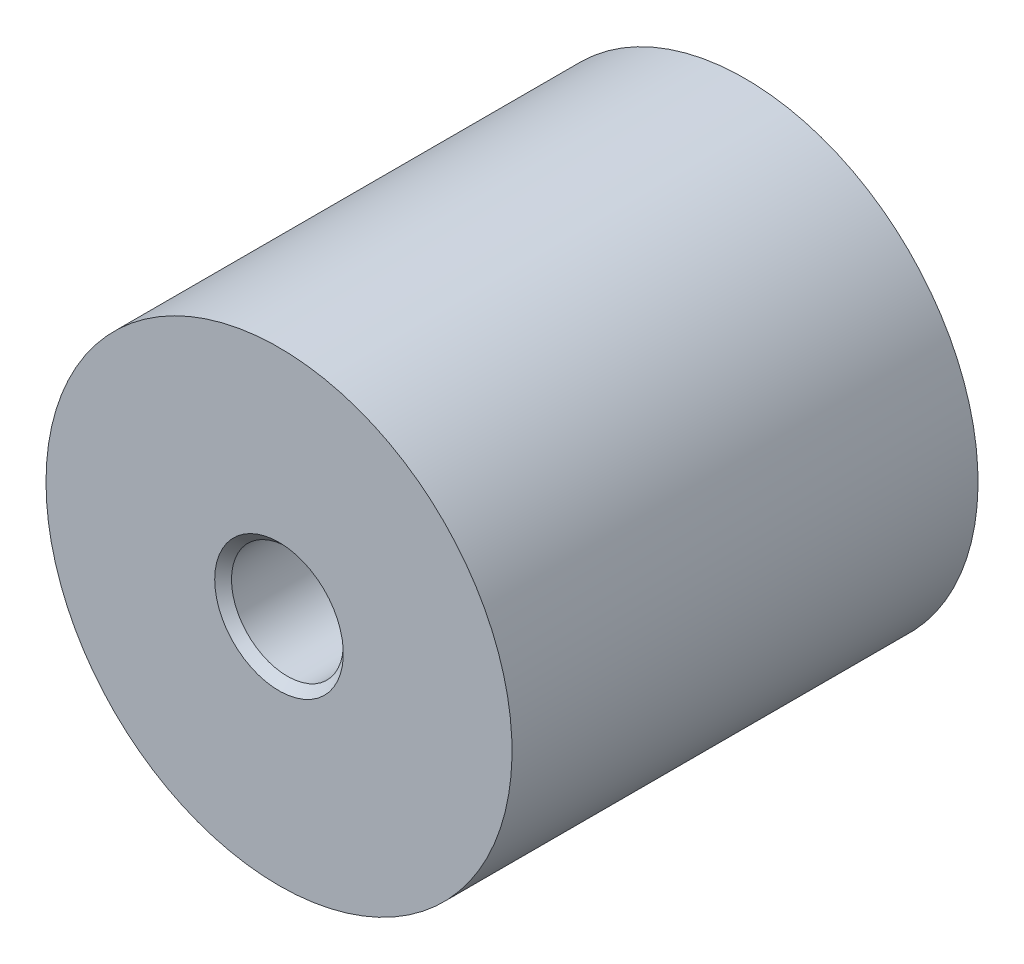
ISO-10303-21;
HEADER;
FILE_DESCRIPTION(('STEP AP214'),'2;1');
FILE_NAME('part.step','',(''),(''),'','','');
FILE_SCHEMA(('AUTOMOTIVE_DESIGN { 1 0 10303 214 1 1 1 1 }'));
ENDSEC;
DATA;
#1=APPLICATION_CONTEXT('core data for automotive mechanical design processes');
#2=APPLICATION_PROTOCOL_DEFINITION('international standard','automotive_design',2000,#1);
#3=PRODUCT_CONTEXT('',#1,'mechanical');
#4=PRODUCT('Part','Part','',(#3));
#5=PRODUCT_RELATED_PRODUCT_CATEGORY('part','',(#4));
#6=PRODUCT_DEFINITION_FORMATION('','',#4);
#7=PRODUCT_DEFINITION_CONTEXT('part definition',#1,'design');
#8=PRODUCT_DEFINITION('design','',#6,#7);
#9=PRODUCT_DEFINITION_SHAPE('','',#8);
#10=(LENGTH_UNIT() NAMED_UNIT(*) SI_UNIT(.MILLI.,.METRE.));
#11=(NAMED_UNIT(*) PLANE_ANGLE_UNIT() SI_UNIT($,.RADIAN.));
#12=(NAMED_UNIT(*) SI_UNIT($,.STERADIAN.) SOLID_ANGLE_UNIT());
#13=UNCERTAINTY_MEASURE_WITH_UNIT(LENGTH_MEASURE(1.E-05),#10,'distance_accuracy_value','');
#14=(GEOMETRIC_REPRESENTATION_CONTEXT(3) GLOBAL_UNCERTAINTY_ASSIGNED_CONTEXT((#13)) GLOBAL_UNIT_ASSIGNED_CONTEXT((#10,
#11,#12)) REPRESENTATION_CONTEXT('',''));
#15=CARTESIAN_POINT('',(0.,0.,0.));
#16=DIRECTION('',(0.,0.,1.));
#17=DIRECTION('',(1.,0.,0.));
#18=AXIS2_PLACEMENT_3D('',#15,#16,#17);
#19=CARTESIAN_POINT('',(0.,0.,0.66666666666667));
#20=DIRECTION('',(0.,0.,1.));
#21=DIRECTION('',(0.,-1.,0.));
#22=AXIS2_PLACEMENT_3D('',#19,#20,#21);
#23=CYLINDRICAL_SURFACE('',#22,12.5);
#24=CARTESIAN_POINT('',(0.,0.,0.));
#25=DIRECTION('',(0.,0.,1.));
#26=DIRECTION('',(0.,-1.,0.));
#27=AXIS2_PLACEMENT_3D('',#24,#25,#26);
#28=CIRCLE('',#27,12.5);
#29=CARTESIAN_POINT('',(0.,-12.5,0.));
#30=VERTEX_POINT('',#29);
#31=EDGE_CURVE('E23',#30,#30,#28,.T.);
#32=ORIENTED_EDGE('',*,*,#31,.T.);
#33=EDGE_LOOP('',(#32));
#34=FACE_BOUND('',#33,.T.);
#35=CARTESIAN_POINT('',(0.,0.,25.));
#36=DIRECTION('',(0.,0.,-1.));
#37=DIRECTION('',(-1.,0.,0.));
#38=AXIS2_PLACEMENT_3D('',#35,#36,#37);
#39=CIRCLE('',#38,12.5);
#40=CARTESIAN_POINT('',(-12.5,0.,25.));
#41=VERTEX_POINT('',#40);
#42=EDGE_CURVE('E32',#41,#41,#39,.T.);
#43=ORIENTED_EDGE('',*,*,#42,.T.);
#44=EDGE_LOOP('',(#43));
#45=FACE_BOUND('',#44,.T.);
#46=ADVANCED_FACE('F12',(#34,#45),#23,.T.);
#47=CARTESIAN_POINT('',(12.5,0.,0.));
#48=DIRECTION('',(0.,0.,-1.));
#49=DIRECTION('',(0.,1.,0.));
#50=AXIS2_PLACEMENT_3D('',#47,#48,#49);
#51=PLANE('',#50);
#52=CARTESIAN_POINT('',(0.,0.,0.));
#53=DIRECTION('',(0.,0.,-1.));
#54=DIRECTION('',(0.,1.,0.));
#55=AXIS2_PLACEMENT_3D('',#52,#53,#54);
#56=CIRCLE('',#55,3.45);
#57=CARTESIAN_POINT('',(0.,3.45,0.));
#58=VERTEX_POINT('',#57);
#59=EDGE_CURVE('E8',#58,#58,#56,.F.);
#60=ORIENTED_EDGE('',*,*,#59,.T.);
#61=EDGE_LOOP('',(#60));
#62=FACE_BOUND('',#61,.T.);
#63=ORIENTED_EDGE('',*,*,#31,.F.);
#64=EDGE_LOOP('',(#63));
#65=FACE_BOUND('',#64,.T.);
#66=ADVANCED_FACE('F59',(#62,#65),#51,.T.);
#67=CARTESIAN_POINT('',(0.,0.,0.));
#68=DIRECTION('',(0.,0.,1.));
#69=DIRECTION('',(0.,-1.,0.));
#70=AXIS2_PLACEMENT_3D('',#67,#68,#69);
#71=CYLINDRICAL_SURFACE('',#70,3.);
#72=CARTESIAN_POINT('',(0.,0.,0.45));
#73=DIRECTION('',(0.,0.,-1.));
#74=DIRECTION('',(0.,1.,0.));
#75=AXIS2_PLACEMENT_3D('',#72,#73,#74);
#76=CIRCLE('',#75,3.);
#77=CARTESIAN_POINT('',(0.,3.,0.45));
#78=VERTEX_POINT('',#77);
#79=EDGE_CURVE('E19',#78,#78,#76,.T.);
#80=ORIENTED_EDGE('',*,*,#79,.T.);
#81=EDGE_LOOP('',(#80));
#82=FACE_BOUND('',#81,.T.);
#83=CARTESIAN_POINT('',(0.,0.,6.));
#84=DIRECTION('',(0.,0.,-1.));
#85=DIRECTION('',(0.,1.,0.));
#86=AXIS2_PLACEMENT_3D('',#83,#84,#85);
#87=CIRCLE('',#86,3.);
#88=CARTESIAN_POINT('',(0.,3.,6.));
#89=VERTEX_POINT('',#88);
#90=EDGE_CURVE('E27',#89,#89,#87,.T.);
#91=ORIENTED_EDGE('',*,*,#90,.F.);
#92=EDGE_LOOP('',(#91));
#93=FACE_BOUND('',#92,.T.);
#94=ADVANCED_FACE('F64',(#82,#93),#71,.F.);
#95=CARTESIAN_POINT('',(0.,0.,6.));
#96=DIRECTION('',(0.,0.,-1.));
#97=DIRECTION('',(0.,1.,0.));
#98=AXIS2_PLACEMENT_3D('',#95,#96,#97);
#99=PLANE('',#98);
#100=ORIENTED_EDGE('',*,*,#90,.T.);
#101=EDGE_LOOP('',(#100));
#102=FACE_BOUND('',#101,.T.);
#103=ADVANCED_FACE('F69',(#102),#99,.T.);
#104=CARTESIAN_POINT('',(0.,0.,0.45));
#105=DIRECTION('',(0.,0.,-1.));
#106=DIRECTION('',(0.,1.,0.));
#107=AXIS2_PLACEMENT_3D('',#104,#105,#106);
#108=CONICAL_SURFACE('',#107,3.,0.785398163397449);
#109=ORIENTED_EDGE('',*,*,#59,.F.);
#110=EDGE_LOOP('',(#109));
#111=FACE_BOUND('',#110,.T.);
#112=ORIENTED_EDGE('',*,*,#79,.F.);
#113=EDGE_LOOP('',(#112));
#114=FACE_BOUND('',#113,.T.);
#115=ADVANCED_FACE('F14',(#111,#114),#108,.F.);
#116=CARTESIAN_POINT('',(0.,0.,25.));
#117=DIRECTION('',(0.,0.,1.));
#118=DIRECTION('',(1.,0.,0.));
#119=AXIS2_PLACEMENT_3D('',#116,#117,#118);
#120=CONICAL_SURFACE('',#119,3.45,0.785398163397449);
#121=CARTESIAN_POINT('',(0.,0.,24.55));
#122=DIRECTION('',(0.,0.,-1.));
#123=DIRECTION('',(-1.,0.,0.));
#124=AXIS2_PLACEMENT_3D('',#121,#122,#123);
#125=CIRCLE('',#124,3.);
#126=CARTESIAN_POINT('',(-3.,0.,24.55));
#127=VERTEX_POINT('',#126);
#128=EDGE_CURVE('E38',#127,#127,#125,.T.);
#129=ORIENTED_EDGE('',*,*,#128,.T.);
#130=EDGE_LOOP('',(#129));
#131=FACE_BOUND('',#130,.T.);
#132=CARTESIAN_POINT('',(0.,0.,25.));
#133=DIRECTION('',(0.,0.,-1.));
#134=DIRECTION('',(-1.,0.,0.));
#135=AXIS2_PLACEMENT_3D('',#132,#133,#134);
#136=CIRCLE('',#135,3.45);
#137=CARTESIAN_POINT('',(-3.45,0.,25.));
#138=VERTEX_POINT('',#137);
#139=EDGE_CURVE('E35',#138,#138,#136,.T.);
#140=ORIENTED_EDGE('',*,*,#139,.F.);
#141=EDGE_LOOP('',(#140));
#142=FACE_BOUND('',#141,.T.);
#143=ADVANCED_FACE('F75',(#131,#142),#120,.F.);
#144=CARTESIAN_POINT('',(0.,12.5,25.));
#145=DIRECTION('',(0.,0.,1.));
#146=DIRECTION('',(1.,0.,0.));
#147=AXIS2_PLACEMENT_3D('',#144,#145,#146);
#148=PLANE('',#147);
#149=ORIENTED_EDGE('',*,*,#139,.T.);
#150=EDGE_LOOP('',(#149));
#151=FACE_BOUND('',#150,.T.);
#152=ORIENTED_EDGE('',*,*,#42,.F.);
#153=EDGE_LOOP('',(#152));
#154=FACE_BOUND('',#153,.T.);
#155=ADVANCED_FACE('F55',(#151,#154),#148,.T.);
#156=CARTESIAN_POINT('',(0.,0.,16.));
#157=DIRECTION('',(0.,0.,1.));
#158=DIRECTION('',(0.,-1.,0.));
#159=AXIS2_PLACEMENT_3D('',#156,#157,#158);
#160=CYLINDRICAL_SURFACE('',#159,3.);
#161=CARTESIAN_POINT('',(0.,0.,19.));
#162=DIRECTION('',(0.,0.,-1.));
#163=DIRECTION('',(-1.,0.,0.));
#164=AXIS2_PLACEMENT_3D('',#161,#162,#163);
#165=CIRCLE('',#164,3.);
#166=CARTESIAN_POINT('',(-3.,0.,19.));
#167=VERTEX_POINT('',#166);
#168=EDGE_CURVE('E41',#167,#167,#165,.T.);
#169=ORIENTED_EDGE('',*,*,#168,.T.);
#170=EDGE_LOOP('',(#169));
#171=FACE_BOUND('',#170,.T.);
#172=ORIENTED_EDGE('',*,*,#128,.F.);
#173=EDGE_LOOP('',(#172));
#174=FACE_BOUND('',#173,.T.);
#175=ADVANCED_FACE('F45',(#171,#174),#160,.F.);
#176=CARTESIAN_POINT('',(0.,3.,19.));
#177=DIRECTION('',(0.,0.,1.));
#178=DIRECTION('',(1.,0.,0.));
#179=AXIS2_PLACEMENT_3D('',#176,#177,#178);
#180=PLANE('',#179);
#181=ORIENTED_EDGE('',*,*,#168,.F.);
#182=EDGE_LOOP('',(#181));
#183=FACE_BOUND('',#182,.T.);
#184=ADVANCED_FACE('F48',(#183),#180,.T.);
#185=CLOSED_SHELL('',(#46,#66,#94,#103,#115,#143,#155,#175,#184));
#186=MANIFOLD_SOLID_BREP('B1',#185);
#187=ADVANCED_BREP_SHAPE_REPRESENTATION('',(#18,#186),#14);
#188=SHAPE_DEFINITION_REPRESENTATION(#9,#187);
ENDSEC;
END-ISO-10303-21;
